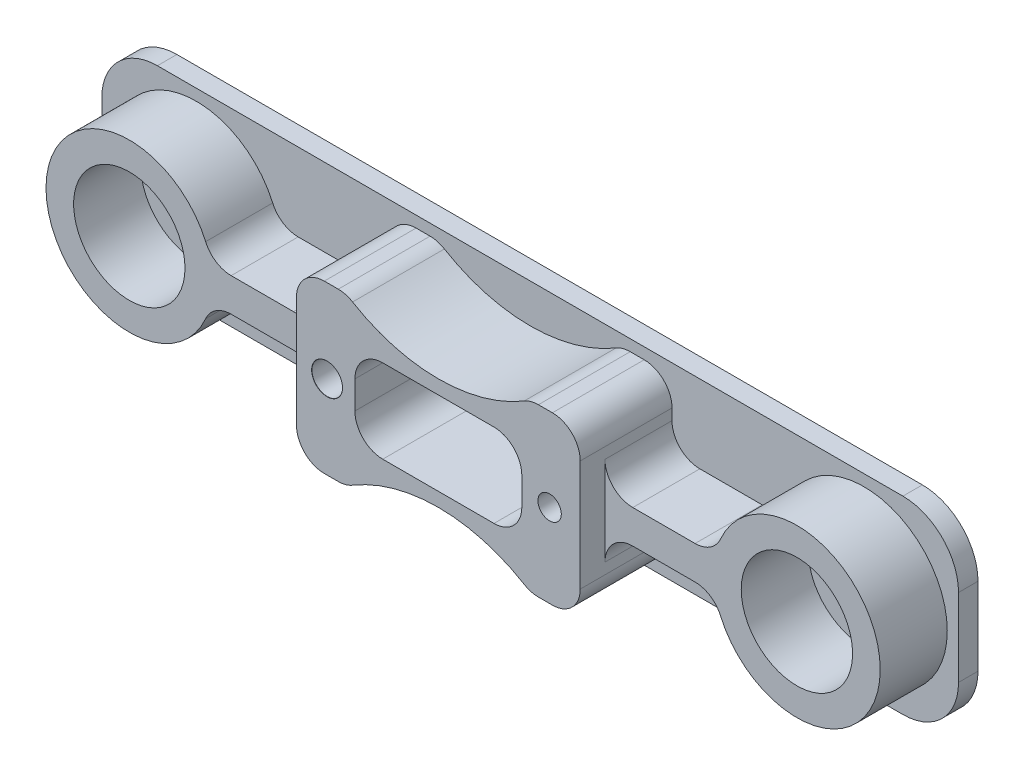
from build123d import *

# Parameters (mm, degrees)
AUFSATZ_LINEAR_AUSTRAGEN1_DEPTH = 3.5
AUFSATZ_LINEAR_AUSTRAGEN2_DEPTH = 16.5
SKIZZE3_R                       = 30
SCHNITT_LINEAR_AUSTRAGEN2_DEPTH = 16.5
VERRUNDUNG1_R                   = 5
SKIZZE4_R                       = 10.00825
AUFSATZ_LINEAR_AUSTRAGEN3_DEPTH = 12.05
VERRUNDUNG2_R                   = 5
M5_GEWINDEBOHRUNG1_D            = 4.2
M5_GEWINDEBOHRUNG1_DEPTH        = 17
M5_GEWINDEBOHRUNG1_TIP          = 1.2618073


with BuildPart() as part:
    # Skizze1 → Aufsatz-Linear austragen1 (new body)
    with BuildSketch(Plane.XY):
        with BuildLine():
            Line((67, -17), (-67, -17))
            ThreePointArc((-67, -17), (-74.071067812, -14.071067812), (-77, -7))
            Line((-77, -7), (-77, 7))
            ThreePointArc((-77, 7), (-74.071067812, 14.071067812), (-67, 17))
            Line((-67, 17), (67, 17))
            ThreePointArc((67, 17), (74.071067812, 14.071067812), (77, 7))
            Line((77, 7), (77, -7))
            ThreePointArc((77, -7), (74.071067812, -14.071067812), (67, -17))
        make_face()
    extrude(amount=AUFSATZ_LINEAR_AUSTRAGEN1_DEPTH)

    # Skizze2 → Aufsatz-Linear austragen2 (add)
    with BuildSketch(Plane.XY.offset(3.5)):
        with BuildLine():
            Line((-20.5, -14.975), (20.5, -14.975))
            ThreePointArc((20.5, -14.975), (24.035533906, -13.510533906), (25.5, -9.975))
            Line((25.5, -9.975), (25.5, 9.975))
            ThreePointArc((25.5, 9.975), (24.035533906, 13.510533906), (20.5, 14.975))
            Line((20.5, 14.975), (-20.5, 14.975))
            ThreePointArc((-20.5, 14.975), (-24.035533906, 13.510533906), (-25.5, 9.975))
            Line((-25.5, 9.975), (-25.5, -9.975))
            ThreePointArc((-25.5, -9.975), (-24.035533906, -13.510533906), (-20.5, -14.975))
        make_face()
        with BuildLine():
            Line((-10, 7.5), (10, 7.5))
            ThreePointArc((10, 7.5), (13.535533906, 6.035533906), (15, 2.5))
            Line((15, 2.5), (15, -2.5))
            ThreePointArc((15, -2.5), (13.535533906, -6.035533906), (10, -7.5))
            Line((10, -7.5), (-10, -7.5))
            ThreePointArc((-10, -7.5), (-13.535533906, -6.035533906), (-15, -2.5))
            Line((-15, -2.5), (-15, 2.5))
            ThreePointArc((-15, 2.5), (-13.535533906, 6.035533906), (-10, 7.5))
        make_face(mode=Mode.SUBTRACT)
    extrude(amount=AUFSATZ_LINEAR_AUSTRAGEN2_DEPTH)

    # Skizze3 → Schnitt-Linear austragen2 (cut)
    with BuildSketch(Plane.XY.offset(20)):
        with Locations((0, -40)):
            Circle(SKIZZE3_R)
        with Locations((0, 40)):
            Circle(SKIZZE3_R)
    extrude(amount=-SCHNITT_LINEAR_AUSTRAGEN2_DEPTH, mode=Mode.SUBTRACT)

    # Verrundung1
    verrundung1_edges = [part.edges().sort_by_distance(p)[0] for p in [
        (16.54537322, -14.975, 11.75),
        (-16.54537322, -14.975, 11.75),
        (-16.54537322, 14.975, 11.75),
        (16.54537322, 14.975, 11.75),
    ]]
    fillet(verrundung1_edges, radius=VERRUNDUNG1_R)

    # Skizze4 → Aufsatz-Linear austragen3 (add)
    # profile 1 of 2: a face of its own
    with BuildSketch(Plane.XY.offset(3.5)):
        with BuildLine():
            Line((-25.5, 3), (-45.328577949, 3))
            ThreePointArc((-45.328577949, 3), (-74.975, 0), (-45.328577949, -3))
            Line((-45.328577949, -3), (-25.5, -3))
            Line((-25.5, -3), (-25.5, 3))
        make_face()
        with Locations((-60, 0)):
            Circle(SKIZZE4_R, mode=Mode.SUBTRACT)
    # profile 2 of 2: a face of its own
    with BuildSketch(Plane.XY.offset(3.5)):
        with BuildLine():
            Line((25.5, 3), (25.5, -3))
            Line((25.5, -3), (45.328577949, -3))
            ThreePointArc((45.328577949, -3), (74.975, 0), (45.328577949, 3))
            Line((45.328577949, 3), (25.5, 3))
        make_face()
        with Locations(Location((60, 0, 0), (0, 0, 180))):
            Circle(SKIZZE4_R, mode=Mode.SUBTRACT)
    extrude(amount=AUFSATZ_LINEAR_AUSTRAGEN3_DEPTH)

    # Verrundung2
    verrundung2_edges = [part.edges().sort_by_distance(p)[0] for p in [
        (-25.5, -3, 9.525),
        (-25.5, 3, 9.525),
        (-45.328577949, 3, 9.525),
        (-45.328577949, -3, 9.525),
        (45.328577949, -3, 9.525),
        (45.328577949, 3, 9.525),
        (25.5, 3, 9.525),
        (25.5, -3, 9.525),
    ]]
    fillet(verrundung2_edges, radius=VERRUNDUNG2_R)

    # Skizze5 → Formsenkung f_r M5 Senkschraube mit Inne (revolve, cut)
    with BuildSketch(Plane.YZ.offset(-20)):
        Polygon((0, 0), (0, 20), (2.775, 20), (2.75, 19.975), (2.75, 2.95), (5.2, 0.5), (5.2, 0), align=None)
    revolve(axis=Axis((-20, 0, -6.35), (0, 0, 1)), mode=Mode.SUBTRACT)

    # M5 Gewindebohrung1
    with Locations(Plane.XY.offset(20)):
        with Locations((20, 0)):
            Hole(M5_GEWINDEBOHRUNG1_D / 2, depth=M5_GEWINDEBOHRUNG1_DEPTH)
            with Locations((0, 0, -(M5_GEWINDEBOHRUNG1_DEPTH + M5_GEWINDEBOHRUNG1_TIP / 2))):  # 118° drill point
                Cone(0, M5_GEWINDEBOHRUNG1_D / 2, M5_GEWINDEBOHRUNG1_TIP, mode=Mode.SUBTRACT)


solid = part.part
